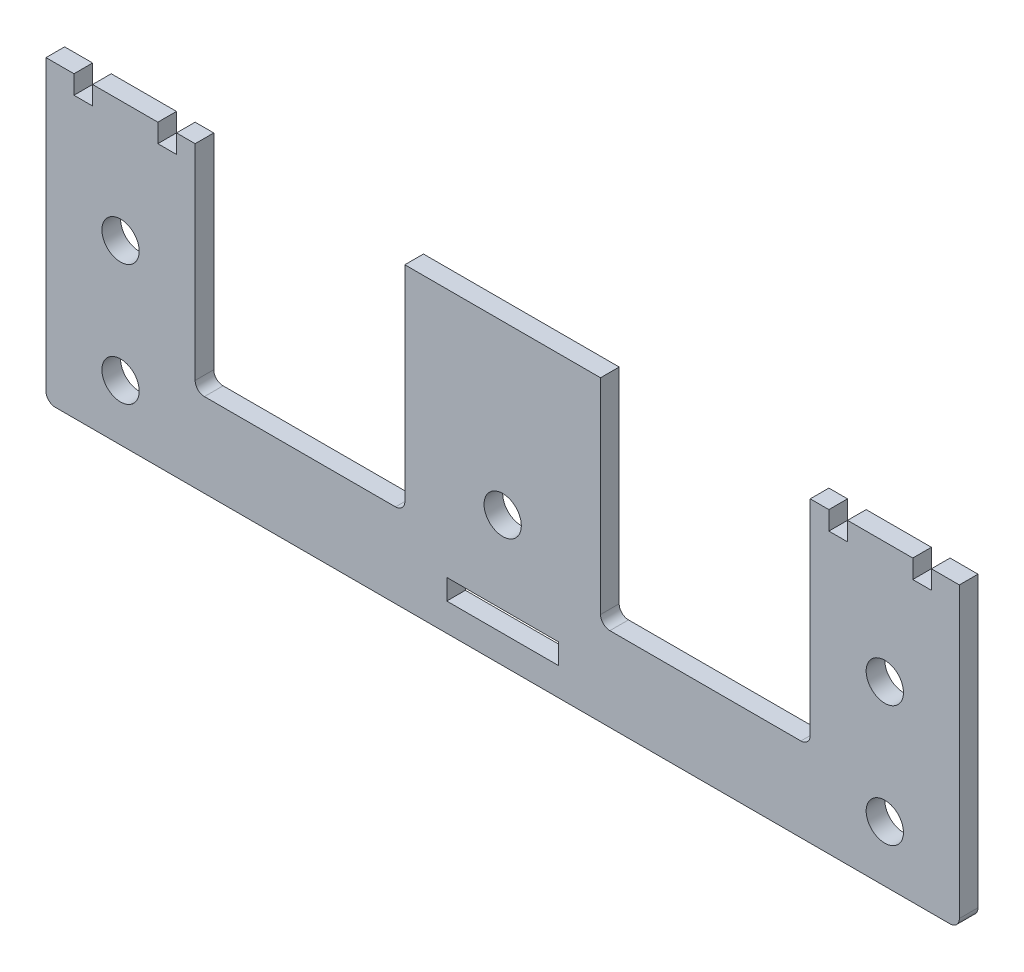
from build123d import *

# Parameters (mm, degrees)
ESQUISSE1_R      = 1
ESQUISSE1_W      = 6
ESQUISSE1_H      = 1.1
EXTRUSION1_DEPTH = 1


with BuildPart() as part:
    # Esquisse1 → Extrusion1 (new body)
    with BuildSketch(Plane.XY):
        with BuildLine():
            Line((-24, 0), (24, 0))
            ThreePointArc((24, 0), (24.353553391, 0.146446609), (24.5, 0.5))
            Line((24.5, 0.5), (24.5, 16))
            Line((24.5, 16), (23, 16))
            Line((23, 16), (23, 15))
            Line((23, 15), (22, 15))
            Line((22, 15), (22, 16))
            Line((22, 16), (18.5, 16))
            Line((18.5, 16), (18.5, 15))
            Line((18.5, 15), (17.5, 15))
            Line((17.5, 15), (17.5, 16))
            Line((17.5, 16), (16.5, 16))
            Line((16.5, 16), (16.5, 5))
            ThreePointArc((16.5, 5), (16.353553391, 4.646446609), (16, 4.5))
            Line((16, 4.5), (5.75, 4.5))
            ThreePointArc((5.75, 4.5), (5.396446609, 4.646446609), (5.25, 5))
            Line((5.25, 5), (5.25, 16))
            Line((5.25, 16), (-5.25, 16))
            Line((-5.25, 16), (-5.25, 5))
            ThreePointArc((-5.25, 5), (-5.396446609, 4.646446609), (-5.75, 4.5))
            Line((-5.75, 4.5), (-16, 4.5))
            ThreePointArc((-16, 4.5), (-16.353553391, 4.646446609), (-16.5, 5))
            Line((-16.5, 5), (-16.5, 16))
            Line((-16.5, 16), (-17.5, 16))
            Line((-17.5, 16), (-17.5, 15))
            Line((-17.5, 15), (-18.5, 15))
            Line((-18.5, 15), (-18.5, 16))
            Line((-18.5, 16), (-22, 16))
            Line((-22, 16), (-22, 15))
            Line((-22, 15), (-23, 15))
            Line((-23, 15), (-23, 16))
            Line((-23, 16), (-24.5, 16))
            Line((-24.5, 16), (-24.5, 0.5))
            ThreePointArc((-24.5, 0.5), (-24.353553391, 0.146446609), (-24, 0))
        make_face()
        with Locations((20.5, 3)):
            Circle(ESQUISSE1_R, mode=Mode.SUBTRACT)
        with Locations((20.5, 9.5)):
            Circle(ESQUISSE1_R, mode=Mode.SUBTRACT)
        with Locations((0, 7)):
            Circle(ESQUISSE1_R, mode=Mode.SUBTRACT)
        with Locations((-20.5, 9.5)):
            Circle(ESQUISSE1_R, mode=Mode.SUBTRACT)
        with Locations((-20.5, 3)):
            Circle(ESQUISSE1_R, mode=Mode.SUBTRACT)
        with Locations((0, 2.05)):
            Rectangle(ESQUISSE1_W, ESQUISSE1_H, mode=Mode.SUBTRACT)
    extrude(amount=EXTRUSION1_DEPTH)


solid = part.part
